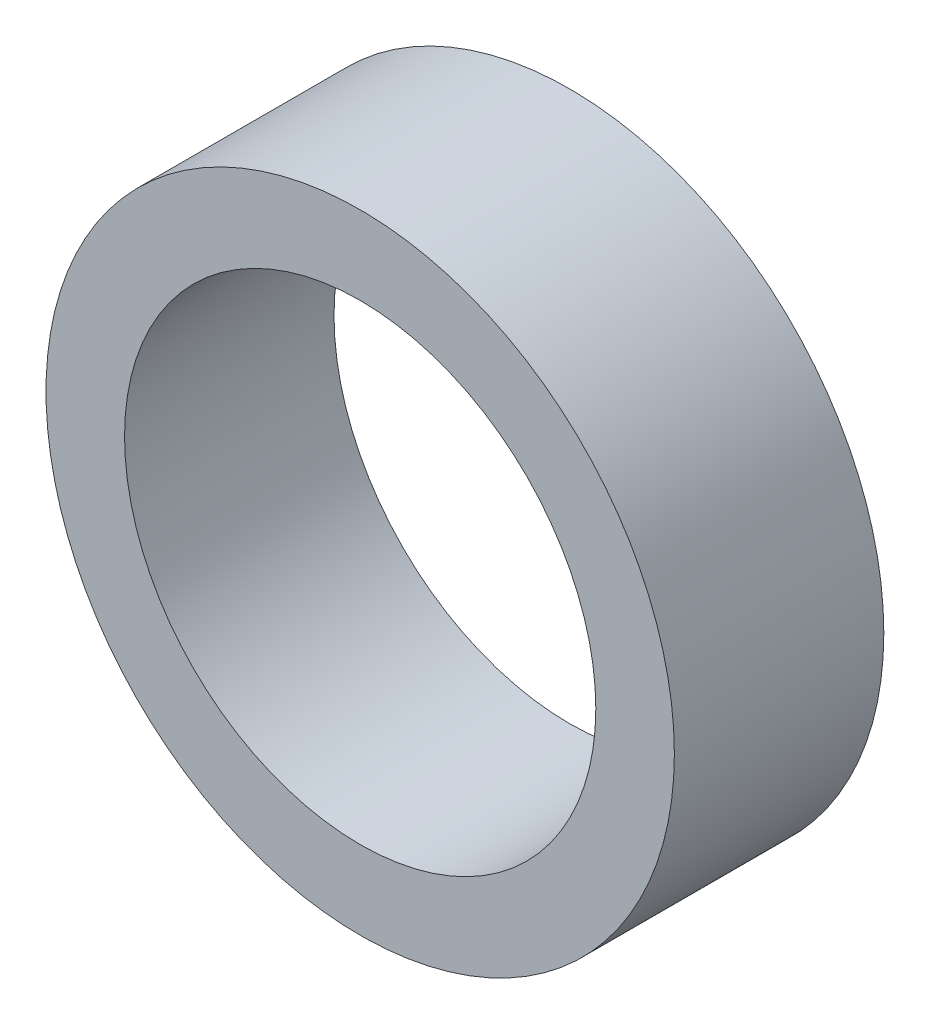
ISO-10303-21;
HEADER;
FILE_DESCRIPTION(('STEP AP214'),'2;1');
FILE_NAME('part.step','',(''),(''),'','','');
FILE_SCHEMA(('AUTOMOTIVE_DESIGN { 1 0 10303 214 1 1 1 1 }'));
ENDSEC;
DATA;
#1=APPLICATION_CONTEXT('core data for automotive mechanical design processes');
#2=APPLICATION_PROTOCOL_DEFINITION('international standard','automotive_design',2000,#1);
#3=PRODUCT_CONTEXT('',#1,'mechanical');
#4=PRODUCT('Part','Part','',(#3));
#5=PRODUCT_RELATED_PRODUCT_CATEGORY('part','',(#4));
#6=PRODUCT_DEFINITION_FORMATION('','',#4);
#7=PRODUCT_DEFINITION_CONTEXT('part definition',#1,'design');
#8=PRODUCT_DEFINITION('design','',#6,#7);
#9=PRODUCT_DEFINITION_SHAPE('','',#8);
#10=(LENGTH_UNIT() NAMED_UNIT(*) SI_UNIT(.MILLI.,.METRE.));
#11=(NAMED_UNIT(*) PLANE_ANGLE_UNIT() SI_UNIT($,.RADIAN.));
#12=(NAMED_UNIT(*) SI_UNIT($,.STERADIAN.) SOLID_ANGLE_UNIT());
#13=UNCERTAINTY_MEASURE_WITH_UNIT(LENGTH_MEASURE(1.E-05),#10,'distance_accuracy_value','');
#14=(GEOMETRIC_REPRESENTATION_CONTEXT(3) GLOBAL_UNCERTAINTY_ASSIGNED_CONTEXT((#13)) GLOBAL_UNIT_ASSIGNED_CONTEXT((#10,
#11,#12)) REPRESENTATION_CONTEXT('',''));
#15=CARTESIAN_POINT('',(0.,0.,0.));
#16=DIRECTION('',(0.,0.,1.));
#17=DIRECTION('',(1.,0.,0.));
#18=AXIS2_PLACEMENT_3D('',#15,#16,#17);
#19=CARTESIAN_POINT('',(0.,0.,8.));
#20=DIRECTION('',(0.,0.,1.));
#21=DIRECTION('',(1.,0.,0.));
#22=AXIS2_PLACEMENT_3D('',#19,#20,#21);
#23=PLANE('',#22);
#24=CARTESIAN_POINT('',(0.,0.,8.));
#25=DIRECTION('',(0.,0.,1.));
#26=DIRECTION('',(1.,0.,0.));
#27=AXIS2_PLACEMENT_3D('',#24,#25,#26);
#28=CIRCLE('',#27,12.);
#29=CARTESIAN_POINT('',(12.,0.,8.));
#30=VERTEX_POINT('',#29);
#31=EDGE_CURVE('E10',#30,#30,#28,.T.);
#32=ORIENTED_EDGE('',*,*,#31,.T.);
#33=EDGE_LOOP('',(#32));
#34=FACE_BOUND('',#33,.T.);
#35=CARTESIAN_POINT('',(0.,0.,8.));
#36=DIRECTION('',(0.,0.,1.));
#37=DIRECTION('',(1.,0.,0.));
#38=AXIS2_PLACEMENT_3D('',#35,#36,#37);
#39=CIRCLE('',#38,9.);
#40=CARTESIAN_POINT('',(9.,0.,8.));
#41=VERTEX_POINT('',#40);
#42=EDGE_CURVE('E40',#41,#41,#39,.T.);
#43=ORIENTED_EDGE('',*,*,#42,.F.);
#44=EDGE_LOOP('',(#43));
#45=FACE_BOUND('',#44,.T.);
#46=ADVANCED_FACE('F29',(#34,#45),#23,.T.);
#47=CARTESIAN_POINT('',(0.,0.,0.));
#48=DIRECTION('',(0.,0.,1.));
#49=DIRECTION('',(1.,0.,0.));
#50=AXIS2_PLACEMENT_3D('',#47,#48,#49);
#51=PLANE('',#50);
#52=CARTESIAN_POINT('',(0.,0.,0.));
#53=DIRECTION('',(0.,0.,1.));
#54=DIRECTION('',(1.,0.,0.));
#55=AXIS2_PLACEMENT_3D('',#52,#53,#54);
#56=CIRCLE('',#55,12.);
#57=CARTESIAN_POINT('',(12.,0.,0.));
#58=VERTEX_POINT('',#57);
#59=EDGE_CURVE('E33',#58,#58,#56,.T.);
#60=ORIENTED_EDGE('',*,*,#59,.F.);
#61=EDGE_LOOP('',(#60));
#62=FACE_BOUND('',#61,.T.);
#63=CARTESIAN_POINT('',(0.,0.,0.));
#64=DIRECTION('',(0.,0.,1.));
#65=DIRECTION('',(1.,0.,0.));
#66=AXIS2_PLACEMENT_3D('',#63,#64,#65);
#67=CIRCLE('',#66,9.);
#68=CARTESIAN_POINT('',(9.,0.,0.));
#69=VERTEX_POINT('',#68);
#70=EDGE_CURVE('E42',#69,#69,#67,.T.);
#71=ORIENTED_EDGE('',*,*,#70,.T.);
#72=EDGE_LOOP('',(#71));
#73=FACE_BOUND('',#72,.T.);
#74=ADVANCED_FACE('F52',(#62,#73),#51,.F.);
#75=CARTESIAN_POINT('',(0.,0.,8.));
#76=DIRECTION('',(0.,0.,-1.));
#77=DIRECTION('',(-1.,0.,0.));
#78=AXIS2_PLACEMENT_3D('',#75,#76,#77);
#79=CYLINDRICAL_SURFACE('',#78,12.);
#80=ORIENTED_EDGE('',*,*,#31,.F.);
#81=EDGE_LOOP('',(#80));
#82=FACE_BOUND('',#81,.T.);
#83=ORIENTED_EDGE('',*,*,#59,.T.);
#84=EDGE_LOOP('',(#83));
#85=FACE_BOUND('',#84,.T.);
#86=ADVANCED_FACE('F31',(#82,#85),#79,.T.);
#87=CARTESIAN_POINT('',(0.,0.,8.));
#88=DIRECTION('',(0.,0.,-1.));
#89=DIRECTION('',(-1.,0.,0.));
#90=AXIS2_PLACEMENT_3D('',#87,#88,#89);
#91=CYLINDRICAL_SURFACE('',#90,9.);
#92=ORIENTED_EDGE('',*,*,#42,.T.);
#93=EDGE_LOOP('',(#92));
#94=FACE_BOUND('',#93,.T.);
#95=ORIENTED_EDGE('',*,*,#70,.F.);
#96=EDGE_LOOP('',(#95));
#97=FACE_BOUND('',#96,.T.);
#98=ADVANCED_FACE('F48',(#94,#97),#91,.F.);
#99=CLOSED_SHELL('',(#46,#74,#86,#98));
#100=MANIFOLD_SOLID_BREP('B2',#99);
#101=ADVANCED_BREP_SHAPE_REPRESENTATION('',(#18,#100),#14);
#102=SHAPE_DEFINITION_REPRESENTATION(#9,#101);
ENDSEC;
END-ISO-10303-21;
